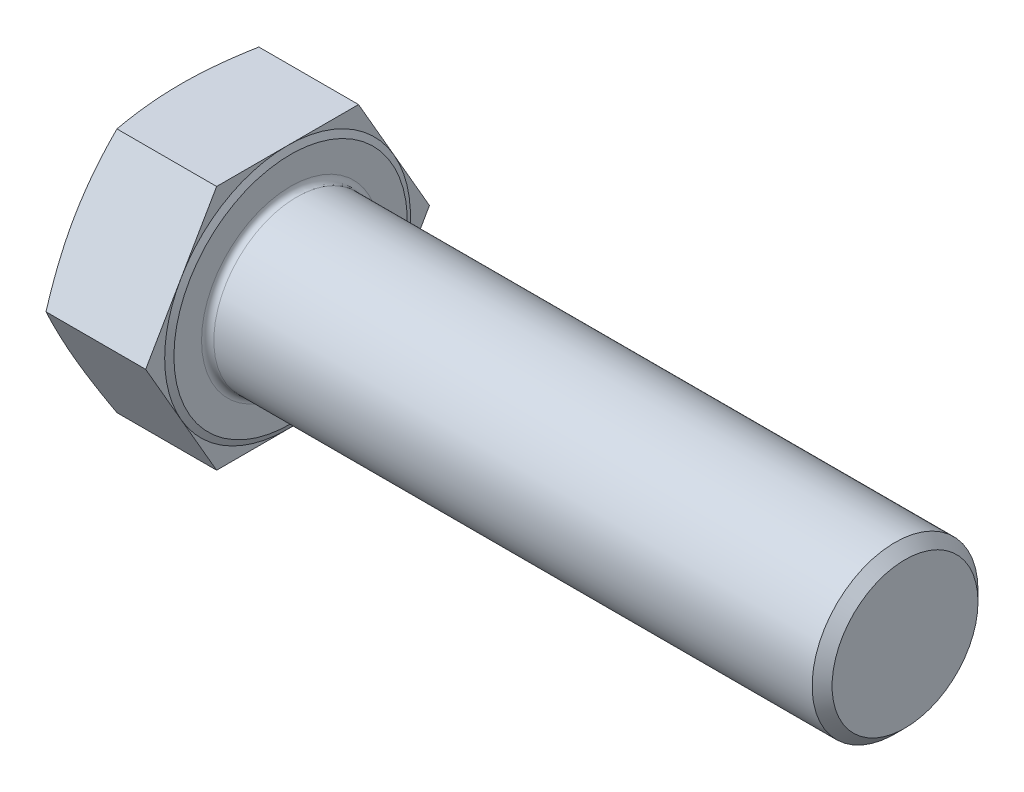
from build123d import *

# Parameters (mm, degrees)
BASEHEAD_DEPTH = 17.35
SKETCH3_R      = 13.5
BASEBODY_DEPTH = 100
HEADFILLET_R   = 1
CHAMFER1_SIZE  = 1.624


with BuildPart() as part:
    # Sketch-BaseHead → BaseHead (new body)
    with BuildSketch(Plane(origin=(0, 0, 0), x_dir=(0, 0, -1), z_dir=(1, 0, 0))):
        Polygon((23.094010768, 0), (11.547005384, 20), (-11.547005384, 20), (-23.094010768, 0), (-11.547005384, -20), (11.547005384, -20), align=None)
    extrude(amount=BASEHEAD_DEPTH)

    # Sketch4 → HeadChamfer (revolve, cut)
    with BuildSketch(Plane(origin=(-0.264637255, 0, 5.916896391), x_dir=(0, 0, -1), z_dir=(0, 1, 0))):
        Polygon((29.010907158, -0.264637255), (25.916896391, -0.264637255), (29.010907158, -1.390765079), align=None)
    revolve(axis=Axis((-4.001564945, 0, 0), (1, 0, 0)), mode=Mode.SUBTRACT)

    # Sketch1 → Revolve1 (revolve)
    with BuildSketch(Plane.XY, mode=Mode.PRIVATE) as revolve1_sk:
        Polygon((17.35, 0), (17.85, 0), (17.85, -19), (17.35, -20), align=None)
    revolve(revolve1_sk.sketch.rotate(Axis((-4.001564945, 0, 0), (1, 0, 0)), 270), axis=Axis((-4.001564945, 0, 0), (1, 0, 0)))

    # Sketch3 → BaseBody (add)
    with BuildSketch(Plane(origin=(17.85, 0, 0), x_dir=(0, 0, -1), z_dir=(1, 0, 0))):
        Circle(SKETCH3_R)
    extrude(amount=BASEBODY_DEPTH)

    # HeadFillet
    headfillet_edges = [part.edges().sort_by_distance(p)[0] for p in [
        (17.85, 0, 13.5),
    ]]
    fillet(headfillet_edges, radius=HEADFILLET_R)

    # Chamfer1
    chamfer1_edges = [part.edges().sort_by_distance(p)[0] for p in [
        (117.85, 0, 13.5),
    ]]
    chamfer(chamfer1_edges, length=CHAMFER1_SIZE)


solid = part.part
